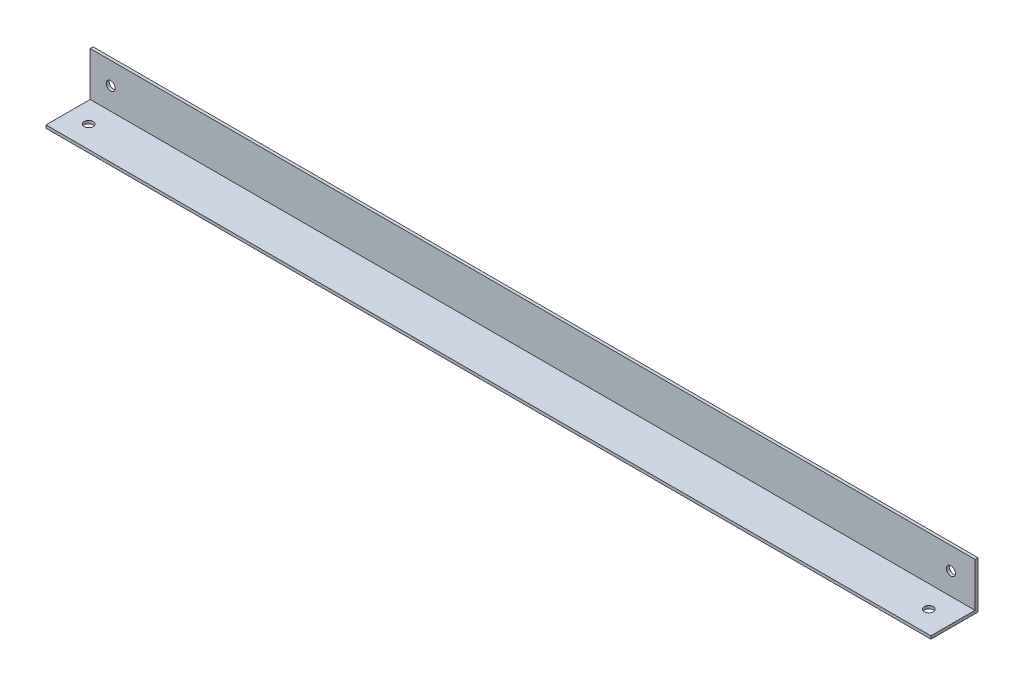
ISO-10303-21;
HEADER;
FILE_DESCRIPTION(('STEP AP214'),'2;1');
FILE_NAME('part.step','',(''),(''),'','','');
FILE_SCHEMA(('AUTOMOTIVE_DESIGN { 1 0 10303 214 1 1 1 1 }'));
ENDSEC;
DATA;
#1=APPLICATION_CONTEXT('core data for automotive mechanical design processes');
#2=APPLICATION_PROTOCOL_DEFINITION('international standard','automotive_design',2000,#1);
#3=PRODUCT_CONTEXT('',#1,'mechanical');
#4=PRODUCT('Part','Part','',(#3));
#5=PRODUCT_RELATED_PRODUCT_CATEGORY('part','',(#4));
#6=PRODUCT_DEFINITION_FORMATION('','',#4);
#7=PRODUCT_DEFINITION_CONTEXT('part definition',#1,'design');
#8=PRODUCT_DEFINITION('design','',#6,#7);
#9=PRODUCT_DEFINITION_SHAPE('','',#8);
#10=(LENGTH_UNIT() NAMED_UNIT(*) SI_UNIT(.MILLI.,.METRE.));
#11=(NAMED_UNIT(*) PLANE_ANGLE_UNIT() SI_UNIT($,.RADIAN.));
#12=(NAMED_UNIT(*) SI_UNIT($,.STERADIAN.) SOLID_ANGLE_UNIT());
#13=UNCERTAINTY_MEASURE_WITH_UNIT(LENGTH_MEASURE(1.E-05),#10,'distance_accuracy_value','');
#14=(GEOMETRIC_REPRESENTATION_CONTEXT(3) GLOBAL_UNCERTAINTY_ASSIGNED_CONTEXT((#13)) GLOBAL_UNIT_ASSIGNED_CONTEXT((#10,
#11,#12)) REPRESENTATION_CONTEXT('',''));
#15=CARTESIAN_POINT('',(0.,0.,0.));
#16=DIRECTION('',(0.,0.,1.));
#17=DIRECTION('',(1.,0.,0.));
#18=AXIS2_PLACEMENT_3D('',#15,#16,#17);
#19=CARTESIAN_POINT('',(238.76,0.,0.));
#20=DIRECTION('',(0.,1.,0.));
#21=DIRECTION('',(0.,0.,1.));
#22=AXIS2_PLACEMENT_3D('',#19,#20,#21);
#23=PLANE('',#22);
#24=CARTESIAN_POINT('',(225.7425,0.,13.49375));
#25=DIRECTION('',(0.,1.,0.));
#26=DIRECTION('',(0.,0.,1.));
#27=AXIS2_PLACEMENT_3D('',#24,#25,#26);
#28=CIRCLE('',#27,2.4257);
#29=CARTESIAN_POINT('',(225.7425,0.,15.91945));
#30=VERTEX_POINT('',#29);
#31=EDGE_CURVE('E143',#30,#30,#28,.T.);
#32=ORIENTED_EDGE('',*,*,#31,.T.);
#33=EDGE_LOOP('',(#32));
#34=FACE_BOUND('',#33,.T.);
#35=CARTESIAN_POINT('',(-227.6475,0.,13.4937499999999));
#36=DIRECTION('',(0.,1.,0.));
#37=DIRECTION('',(0.,0.,1.));
#38=AXIS2_PLACEMENT_3D('',#35,#36,#37);
#39=CIRCLE('',#38,2.4257);
#40=CARTESIAN_POINT('',(-227.6475,0.,15.9194499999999));
#41=VERTEX_POINT('',#40);
#42=EDGE_CURVE('E155',#41,#41,#39,.T.);
#43=ORIENTED_EDGE('',*,*,#42,.T.);
#44=EDGE_LOOP('',(#43));
#45=FACE_BOUND('',#44,.T.);
#46=DIRECTION('',(0.,0.,-1.));
#47=VECTOR('',#46,1.);
#48=CARTESIAN_POINT('',(-238.76,0.,0.));
#49=LINE('',#48,#47);
#50=CARTESIAN_POINT('',(-238.76,0.,25.4));
#51=VERTEX_POINT('',#50);
#52=CARTESIAN_POINT('',(-238.76,0.,0.));
#53=VERTEX_POINT('',#52);
#54=EDGE_CURVE('E123',#51,#53,#49,.T.);
#55=ORIENTED_EDGE('',*,*,#54,.T.);
#56=DIRECTION('',(-1.,0.,0.));
#57=VECTOR('',#56,1.);
#58=CARTESIAN_POINT('',(238.76,0.,0.));
#59=LINE('',#58,#57);
#60=CARTESIAN_POINT('',(238.76,0.,0.));
#61=VERTEX_POINT('',#60);
#62=EDGE_CURVE('E11',#61,#53,#59,.T.);
#63=ORIENTED_EDGE('',*,*,#62,.F.);
#64=DIRECTION('',(0.,0.,-1.));
#65=VECTOR('',#64,1.);
#66=CARTESIAN_POINT('',(238.76,0.,0.));
#67=LINE('',#66,#65);
#68=CARTESIAN_POINT('',(238.76,0.,25.4));
#69=VERTEX_POINT('',#68);
#70=EDGE_CURVE('E136',#69,#61,#67,.T.);
#71=ORIENTED_EDGE('',*,*,#70,.F.);
#72=DIRECTION('',(-1.,0.,0.));
#73=VECTOR('',#72,1.);
#74=CARTESIAN_POINT('',(238.76,0.,25.4));
#75=LINE('',#74,#73);
#76=EDGE_CURVE('E122',#69,#51,#75,.T.);
#77=ORIENTED_EDGE('',*,*,#76,.T.);
#78=EDGE_LOOP('',(#55,#63,#71,#77));
#79=FACE_BOUND('',#78,.T.);
#80=ADVANCED_FACE('F39',(#34,#45,#79),#23,.F.);
#81=CARTESIAN_POINT('',(238.76,0.,0.));
#82=DIRECTION('',(0.,0.,1.));
#83=DIRECTION('',(1.,0.,0.));
#84=AXIS2_PLACEMENT_3D('',#81,#82,#83);
#85=PLANE('',#84);
#86=CARTESIAN_POINT('',(225.7425,13.49375,0.));
#87=DIRECTION('',(0.,0.,-1.));
#88=DIRECTION('',(0.,1.,0.));
#89=AXIS2_PLACEMENT_3D('',#86,#87,#88);
#90=CIRCLE('',#89,2.4257);
#91=CARTESIAN_POINT('',(225.7425,15.91945,0.));
#92=VERTEX_POINT('',#91);
#93=EDGE_CURVE('E148',#92,#92,#90,.T.);
#94=ORIENTED_EDGE('',*,*,#93,.F.);
#95=EDGE_LOOP('',(#94));
#96=FACE_BOUND('',#95,.T.);
#97=CARTESIAN_POINT('',(-227.6475,13.4937499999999,0.));
#98=DIRECTION('',(0.,0.,-1.));
#99=DIRECTION('',(0.,1.,0.));
#100=AXIS2_PLACEMENT_3D('',#97,#98,#99);
#101=CIRCLE('',#100,2.4257);
#102=CARTESIAN_POINT('',(-227.6475,15.9194499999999,0.));
#103=VERTEX_POINT('',#102);
#104=EDGE_CURVE('E152',#103,#103,#101,.T.);
#105=ORIENTED_EDGE('',*,*,#104,.F.);
#106=EDGE_LOOP('',(#105));
#107=FACE_BOUND('',#106,.T.);
#108=DIRECTION('',(0.,1.,0.));
#109=VECTOR('',#108,1.);
#110=CARTESIAN_POINT('',(-238.76,0.,0.));
#111=LINE('',#110,#109);
#112=CARTESIAN_POINT('',(-238.76,25.4,0.));
#113=VERTEX_POINT('',#112);
#114=EDGE_CURVE('E130',#53,#113,#111,.T.);
#115=ORIENTED_EDGE('',*,*,#114,.T.);
#116=DIRECTION('',(-1.,0.,0.));
#117=VECTOR('',#116,1.);
#118=CARTESIAN_POINT('',(238.76,25.4,0.));
#119=LINE('',#118,#117);
#120=CARTESIAN_POINT('',(238.76,25.4,0.));
#121=VERTEX_POINT('',#120);
#122=EDGE_CURVE('E48',#121,#113,#119,.T.);
#123=ORIENTED_EDGE('',*,*,#122,.F.);
#124=DIRECTION('',(0.,1.,0.));
#125=VECTOR('',#124,1.);
#126=CARTESIAN_POINT('',(238.76,0.,0.));
#127=LINE('',#126,#125);
#128=EDGE_CURVE('E92',#61,#121,#127,.T.);
#129=ORIENTED_EDGE('',*,*,#128,.F.);
#130=ORIENTED_EDGE('',*,*,#62,.T.);
#131=EDGE_LOOP('',(#115,#123,#129,#130));
#132=FACE_BOUND('',#131,.T.);
#133=ADVANCED_FACE('F169',(#96,#107,#132),#85,.F.);
#134=CARTESIAN_POINT('',(238.76,25.4,0.));
#135=DIRECTION('',(0.,-1.,0.));
#136=DIRECTION('',(0.,0.,-1.));
#137=AXIS2_PLACEMENT_3D('',#134,#135,#136);
#138=PLANE('',#137);
#139=DIRECTION('',(0.,0.,1.));
#140=VECTOR('',#139,1.);
#141=CARTESIAN_POINT('',(-238.76,25.4,0.));
#142=LINE('',#141,#140);
#143=CARTESIAN_POINT('',(-238.76,25.4,1.5875));
#144=VERTEX_POINT('',#143);
#145=EDGE_CURVE('E134',#113,#144,#142,.T.);
#146=ORIENTED_EDGE('',*,*,#145,.T.);
#147=DIRECTION('',(-1.,0.,0.));
#148=VECTOR('',#147,1.);
#149=CARTESIAN_POINT('',(238.76,25.4,1.5875));
#150=LINE('',#149,#148);
#151=CARTESIAN_POINT('',(238.76,25.4,1.5875));
#152=VERTEX_POINT('',#151);
#153=EDGE_CURVE('E116',#152,#144,#150,.T.);
#154=ORIENTED_EDGE('',*,*,#153,.F.);
#155=DIRECTION('',(0.,0.,1.));
#156=VECTOR('',#155,1.);
#157=CARTESIAN_POINT('',(238.76,25.4,0.));
#158=LINE('',#157,#156);
#159=EDGE_CURVE('E110',#121,#152,#158,.T.);
#160=ORIENTED_EDGE('',*,*,#159,.F.);
#161=ORIENTED_EDGE('',*,*,#122,.T.);
#162=EDGE_LOOP('',(#146,#154,#160,#161));
#163=FACE_BOUND('',#162,.T.);
#164=ADVANCED_FACE('F175',(#163),#138,.F.);
#165=CARTESIAN_POINT('',(238.76,1.5875,1.5875));
#166=DIRECTION('',(0.,0.,-1.));
#167=DIRECTION('',(-1.,0.,0.));
#168=AXIS2_PLACEMENT_3D('',#165,#166,#167);
#169=PLANE('',#168);
#170=CARTESIAN_POINT('',(225.7425,13.49375,1.5875));
#171=DIRECTION('',(0.,0.,-1.));
#172=DIRECTION('',(-1.,0.,0.));
#173=AXIS2_PLACEMENT_3D('',#170,#171,#172);
#174=CIRCLE('',#173,2.4257);
#175=CARTESIAN_POINT('',(223.3168,13.49375,1.5875));
#176=VERTEX_POINT('',#175);
#177=EDGE_CURVE('E45',#176,#176,#174,.T.);
#178=ORIENTED_EDGE('',*,*,#177,.T.);
#179=EDGE_LOOP('',(#178));
#180=FACE_BOUND('',#179,.T.);
#181=CARTESIAN_POINT('',(-227.6475,13.4937499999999,1.5875));
#182=DIRECTION('',(0.,0.,-1.));
#183=DIRECTION('',(-1.,0.,0.));
#184=AXIS2_PLACEMENT_3D('',#181,#182,#183);
#185=CIRCLE('',#184,2.4257);
#186=CARTESIAN_POINT('',(-230.0732,13.4937499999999,1.5875));
#187=VERTEX_POINT('',#186);
#188=EDGE_CURVE('E146',#187,#187,#185,.T.);
#189=ORIENTED_EDGE('',*,*,#188,.T.);
#190=EDGE_LOOP('',(#189));
#191=FACE_BOUND('',#190,.T.);
#192=DIRECTION('',(0.,-1.,0.));
#193=VECTOR('',#192,1.);
#194=CARTESIAN_POINT('',(-238.76,1.5875,1.5875));
#195=LINE('',#194,#193);
#196=CARTESIAN_POINT('',(-238.76,1.5875,1.5875));
#197=VERTEX_POINT('',#196);
#198=EDGE_CURVE('E114',#144,#197,#195,.T.);
#199=ORIENTED_EDGE('',*,*,#198,.T.);
#200=DIRECTION('',(-1.,0.,0.));
#201=VECTOR('',#200,1.);
#202=CARTESIAN_POINT('',(238.76,1.5875,1.5875));
#203=LINE('',#202,#201);
#204=CARTESIAN_POINT('',(238.76,1.5875,1.5875));
#205=VERTEX_POINT('',#204);
#206=EDGE_CURVE('E115',#205,#197,#203,.T.);
#207=ORIENTED_EDGE('',*,*,#206,.F.);
#208=DIRECTION('',(0.,-1.,0.));
#209=VECTOR('',#208,1.);
#210=CARTESIAN_POINT('',(238.76,1.5875,1.5875));
#211=LINE('',#210,#209);
#212=EDGE_CURVE('E103',#152,#205,#211,.T.);
#213=ORIENTED_EDGE('',*,*,#212,.F.);
#214=ORIENTED_EDGE('',*,*,#153,.T.);
#215=EDGE_LOOP('',(#199,#207,#213,#214));
#216=FACE_BOUND('',#215,.T.);
#217=ADVANCED_FACE('F113',(#180,#191,#216),#169,.F.);
#218=CARTESIAN_POINT('',(238.76,1.5875,1.5875));
#219=DIRECTION('',(0.,-1.,0.));
#220=DIRECTION('',(0.,0.,-1.));
#221=AXIS2_PLACEMENT_3D('',#218,#219,#220);
#222=PLANE('',#221);
#223=CARTESIAN_POINT('',(225.7425,1.5875,13.49375));
#224=DIRECTION('',(0.,-1.,0.));
#225=DIRECTION('',(0.,0.,-1.));
#226=AXIS2_PLACEMENT_3D('',#223,#224,#225);
#227=CIRCLE('',#226,2.4257);
#228=CARTESIAN_POINT('',(225.7425,1.5875,11.06805));
#229=VERTEX_POINT('',#228);
#230=EDGE_CURVE('E128',#229,#229,#227,.F.);
#231=ORIENTED_EDGE('',*,*,#230,.F.);
#232=EDGE_LOOP('',(#231));
#233=FACE_BOUND('',#232,.T.);
#234=CARTESIAN_POINT('',(-227.6475,1.5875,13.4937499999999));
#235=DIRECTION('',(0.,-1.,0.));
#236=DIRECTION('',(0.,0.,-1.));
#237=AXIS2_PLACEMENT_3D('',#234,#235,#236);
#238=CIRCLE('',#237,2.4257);
#239=CARTESIAN_POINT('',(-227.6475,1.5875,11.06805));
#240=VERTEX_POINT('',#239);
#241=EDGE_CURVE('E145',#240,#240,#238,.F.);
#242=ORIENTED_EDGE('',*,*,#241,.F.);
#243=EDGE_LOOP('',(#242));
#244=FACE_BOUND('',#243,.T.);
#245=DIRECTION('',(0.,0.,1.));
#246=VECTOR('',#245,1.);
#247=CARTESIAN_POINT('',(-238.76,1.5875,1.5875));
#248=LINE('',#247,#246);
#249=CARTESIAN_POINT('',(-238.76,1.5875,25.4));
#250=VERTEX_POINT('',#249);
#251=EDGE_CURVE('E78',#197,#250,#248,.T.);
#252=ORIENTED_EDGE('',*,*,#251,.T.);
#253=DIRECTION('',(-1.,0.,0.));
#254=VECTOR('',#253,1.);
#255=CARTESIAN_POINT('',(238.76,1.5875,25.4));
#256=LINE('',#255,#254);
#257=CARTESIAN_POINT('',(238.76,1.5875,25.4));
#258=VERTEX_POINT('',#257);
#259=EDGE_CURVE('E120',#258,#250,#256,.T.);
#260=ORIENTED_EDGE('',*,*,#259,.F.);
#261=DIRECTION('',(0.,0.,1.));
#262=VECTOR('',#261,1.);
#263=CARTESIAN_POINT('',(238.76,1.5875,1.5875));
#264=LINE('',#263,#262);
#265=EDGE_CURVE('E102',#205,#258,#264,.T.);
#266=ORIENTED_EDGE('',*,*,#265,.F.);
#267=ORIENTED_EDGE('',*,*,#206,.T.);
#268=EDGE_LOOP('',(#252,#260,#266,#267));
#269=FACE_BOUND('',#268,.T.);
#270=ADVANCED_FACE('F118',(#233,#244,#269),#222,.F.);
#271=CARTESIAN_POINT('',(238.76,0.,25.4));
#272=DIRECTION('',(0.,0.,-1.));
#273=DIRECTION('',(-1.,0.,0.));
#274=AXIS2_PLACEMENT_3D('',#271,#272,#273);
#275=PLANE('',#274);
#276=DIRECTION('',(0.,-1.,0.));
#277=VECTOR('',#276,1.);
#278=CARTESIAN_POINT('',(-238.76,0.,25.4));
#279=LINE('',#278,#277);
#280=EDGE_CURVE('E89',#250,#51,#279,.T.);
#281=ORIENTED_EDGE('',*,*,#280,.T.);
#282=ORIENTED_EDGE('',*,*,#76,.F.);
#283=DIRECTION('',(0.,-1.,0.));
#284=VECTOR('',#283,1.);
#285=CARTESIAN_POINT('',(238.76,0.,25.4));
#286=LINE('',#285,#284);
#287=EDGE_CURVE('E60',#258,#69,#286,.T.);
#288=ORIENTED_EDGE('',*,*,#287,.F.);
#289=ORIENTED_EDGE('',*,*,#259,.T.);
#290=EDGE_LOOP('',(#281,#282,#288,#289));
#291=FACE_BOUND('',#290,.T.);
#292=ADVANCED_FACE('F180',(#291),#275,.F.);
#293=CARTESIAN_POINT('',(238.76,0.,0.));
#294=DIRECTION('',(-1.,0.,0.));
#295=DIRECTION('',(0.,0.,1.));
#296=AXIS2_PLACEMENT_3D('',#293,#294,#295);
#297=PLANE('',#296);
#298=ORIENTED_EDGE('',*,*,#70,.T.);
#299=ORIENTED_EDGE('',*,*,#128,.T.);
#300=ORIENTED_EDGE('',*,*,#159,.T.);
#301=ORIENTED_EDGE('',*,*,#212,.T.);
#302=ORIENTED_EDGE('',*,*,#265,.T.);
#303=ORIENTED_EDGE('',*,*,#287,.T.);
#304=EDGE_LOOP('',(#298,#299,#300,#301,#302,#303));
#305=FACE_BOUND('',#304,.T.);
#306=ADVANCED_FACE('F101',(#305),#297,.F.);
#307=CARTESIAN_POINT('',(-238.76,0.,0.));
#308=DIRECTION('',(-1.,0.,0.));
#309=DIRECTION('',(0.,0.,1.));
#310=AXIS2_PLACEMENT_3D('',#307,#308,#309);
#311=PLANE('',#310);
#312=ORIENTED_EDGE('',*,*,#54,.F.);
#313=ORIENTED_EDGE('',*,*,#280,.F.);
#314=ORIENTED_EDGE('',*,*,#251,.F.);
#315=ORIENTED_EDGE('',*,*,#198,.F.);
#316=ORIENTED_EDGE('',*,*,#145,.F.);
#317=ORIENTED_EDGE('',*,*,#114,.F.);
#318=EDGE_LOOP('',(#312,#313,#314,#315,#316,#317));
#319=FACE_BOUND('',#318,.T.);
#320=ADVANCED_FACE('F174',(#319),#311,.T.);
#321=CARTESIAN_POINT('',(-227.6475,25.4,13.4937499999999));
#322=DIRECTION('',(0.,-1.,0.));
#323=DIRECTION('',(0.,0.,-1.));
#324=AXIS2_PLACEMENT_3D('',#321,#322,#323);
#325=CYLINDRICAL_SURFACE('',#324,2.4257);
#326=ORIENTED_EDGE('',*,*,#42,.F.);
#327=EDGE_LOOP('',(#326));
#328=FACE_BOUND('',#327,.T.);
#329=ORIENTED_EDGE('',*,*,#241,.T.);
#330=EDGE_LOOP('',(#329));
#331=FACE_BOUND('',#330,.T.);
#332=ADVANCED_FACE('F197',(#328,#331),#325,.F.);
#333=CARTESIAN_POINT('',(225.7425,25.4,13.49375));
#334=DIRECTION('',(0.,-1.,0.));
#335=DIRECTION('',(0.,0.,-1.));
#336=AXIS2_PLACEMENT_3D('',#333,#334,#335);
#337=CYLINDRICAL_SURFACE('',#336,2.4257);
#338=ORIENTED_EDGE('',*,*,#31,.F.);
#339=EDGE_LOOP('',(#338));
#340=FACE_BOUND('',#339,.T.);
#341=ORIENTED_EDGE('',*,*,#230,.T.);
#342=EDGE_LOOP('',(#341));
#343=FACE_BOUND('',#342,.T.);
#344=ADVANCED_FACE('F203',(#340,#343),#337,.F.);
#345=CARTESIAN_POINT('',(-227.6475,13.49375,25.4));
#346=DIRECTION('',(0.,0.,-1.));
#347=DIRECTION('',(0.,1.,0.));
#348=AXIS2_PLACEMENT_3D('',#345,#346,#347);
#349=CYLINDRICAL_SURFACE('',#348,2.4257);
#350=ORIENTED_EDGE('',*,*,#104,.T.);
#351=EDGE_LOOP('',(#350));
#352=FACE_BOUND('',#351,.T.);
#353=ORIENTED_EDGE('',*,*,#188,.F.);
#354=EDGE_LOOP('',(#353));
#355=FACE_BOUND('',#354,.T.);
#356=ADVANCED_FACE('F208',(#352,#355),#349,.F.);
#357=CARTESIAN_POINT('',(225.7425,13.49375,25.4));
#358=DIRECTION('',(0.,0.,-1.));
#359=DIRECTION('',(0.,1.,0.));
#360=AXIS2_PLACEMENT_3D('',#357,#358,#359);
#361=CYLINDRICAL_SURFACE('',#360,2.4257);
#362=ORIENTED_EDGE('',*,*,#93,.T.);
#363=EDGE_LOOP('',(#362));
#364=FACE_BOUND('',#363,.T.);
#365=ORIENTED_EDGE('',*,*,#177,.F.);
#366=EDGE_LOOP('',(#365));
#367=FACE_BOUND('',#366,.T.);
#368=ADVANCED_FACE('F219',(#364,#367),#361,.F.);
#369=CLOSED_SHELL('',(#80,#133,#164,#217,#270,#292,#306,#320,#332,#344,#356,#368));
#370=MANIFOLD_SOLID_BREP('B2',#369);
#371=ADVANCED_BREP_SHAPE_REPRESENTATION('',(#18,#370),#14);
#372=SHAPE_DEFINITION_REPRESENTATION(#9,#371);
ENDSEC;
END-ISO-10303-21;
